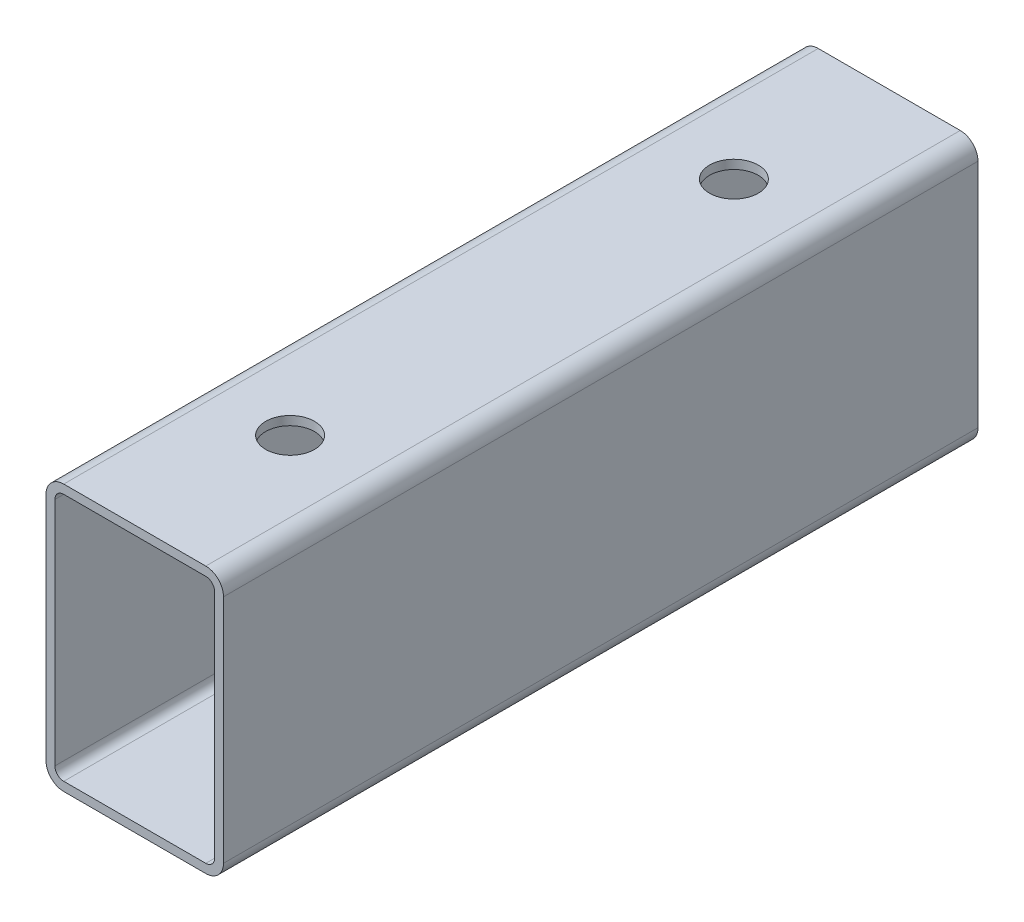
ISO-10303-21;
HEADER;
FILE_DESCRIPTION(('STEP AP214'),'2;1');
FILE_NAME('part.step','',(''),(''),'','','');
FILE_SCHEMA(('AUTOMOTIVE_DESIGN { 1 0 10303 214 1 1 1 1 }'));
ENDSEC;
DATA;
#1=APPLICATION_CONTEXT('core data for automotive mechanical design processes');
#2=APPLICATION_PROTOCOL_DEFINITION('international standard','automotive_design',2000,#1);
#3=PRODUCT_CONTEXT('',#1,'mechanical');
#4=PRODUCT('Part','Part','',(#3));
#5=PRODUCT_RELATED_PRODUCT_CATEGORY('part','',(#4));
#6=PRODUCT_DEFINITION_FORMATION('','',#4);
#7=PRODUCT_DEFINITION_CONTEXT('part definition',#1,'design');
#8=PRODUCT_DEFINITION('design','',#6,#7);
#9=PRODUCT_DEFINITION_SHAPE('','',#8);
#10=(LENGTH_UNIT() NAMED_UNIT(*) SI_UNIT(.MILLI.,.METRE.));
#11=(NAMED_UNIT(*) PLANE_ANGLE_UNIT() SI_UNIT($,.RADIAN.));
#12=(NAMED_UNIT(*) SI_UNIT($,.STERADIAN.) SOLID_ANGLE_UNIT());
#13=UNCERTAINTY_MEASURE_WITH_UNIT(LENGTH_MEASURE(1.E-05),#10,'distance_accuracy_value','');
#14=(GEOMETRIC_REPRESENTATION_CONTEXT(3) GLOBAL_UNCERTAINTY_ASSIGNED_CONTEXT((#13)) GLOBAL_UNIT_ASSIGNED_CONTEXT((#10,
#11,#12)) REPRESENTATION_CONTEXT('',''));
#15=CARTESIAN_POINT('',(0.,0.,0.));
#16=DIRECTION('',(0.,0.,1.));
#17=DIRECTION('',(1.,0.,0.));
#18=AXIS2_PLACEMENT_3D('',#15,#16,#17);
#19=CARTESIAN_POINT('',(16.,30.,85.));
#20=DIRECTION('',(0.,-1.,0.));
#21=DIRECTION('',(1.,0.,0.));
#22=AXIS2_PLACEMENT_3D('',#19,#20,#21);
#23=PLANE('',#22);
#24=CARTESIAN_POINT('',(0.,30.,-50.));
#25=DIRECTION('',(0.,1.,0.));
#26=DIRECTION('',(0.,0.,1.));
#27=AXIS2_PLACEMENT_3D('',#24,#25,#26);
#28=CIRCLE('',#27,5.5);
#29=CARTESIAN_POINT('',(0.,30.,-44.5));
#30=VERTEX_POINT('',#29);
#31=EDGE_CURVE('E269',#30,#30,#28,.T.);
#32=ORIENTED_EDGE('',*,*,#31,.F.);
#33=EDGE_LOOP('',(#32));
#34=FACE_BOUND('',#33,.T.);
#35=DIRECTION('',(-1.,0.,0.));
#36=VECTOR('',#35,1.);
#37=CARTESIAN_POINT('',(16.,30.,-85.));
#38=LINE('',#37,#36);
#39=CARTESIAN_POINT('',(16.,30.,-85.));
#40=VERTEX_POINT('',#39);
#41=CARTESIAN_POINT('',(-16.,30.,-85.));
#42=VERTEX_POINT('',#41);
#43=EDGE_CURVE('E218',#40,#42,#38,.T.);
#44=ORIENTED_EDGE('',*,*,#43,.T.);
#45=DIRECTION('',(0.,0.,-1.));
#46=VECTOR('',#45,1.);
#47=CARTESIAN_POINT('',(-16.,30.,85.));
#48=LINE('',#47,#46);
#49=CARTESIAN_POINT('',(-16.,30.,85.));
#50=VERTEX_POINT('',#49);
#51=EDGE_CURVE('E257',#50,#42,#48,.T.);
#52=ORIENTED_EDGE('',*,*,#51,.F.);
#53=DIRECTION('',(-1.,0.,0.));
#54=VECTOR('',#53,1.);
#55=CARTESIAN_POINT('',(16.,30.,85.));
#56=LINE('',#55,#54);
#57=CARTESIAN_POINT('',(16.,30.,85.));
#58=VERTEX_POINT('',#57);
#59=EDGE_CURVE('E235',#58,#50,#56,.T.);
#60=ORIENTED_EDGE('',*,*,#59,.F.);
#61=DIRECTION('',(0.,0.,-1.));
#62=VECTOR('',#61,1.);
#63=CARTESIAN_POINT('',(16.,30.,85.));
#64=LINE('',#63,#62);
#65=EDGE_CURVE('E260',#58,#40,#64,.T.);
#66=ORIENTED_EDGE('',*,*,#65,.T.);
#67=EDGE_LOOP('',(#44,#52,#60,#66));
#68=FACE_BOUND('',#67,.T.);
#69=CARTESIAN_POINT('',(0.,30.,50.));
#70=DIRECTION('',(0.,1.,0.));
#71=DIRECTION('',(0.,0.,1.));
#72=AXIS2_PLACEMENT_3D('',#69,#70,#71);
#73=CIRCLE('',#72,5.5);
#74=CARTESIAN_POINT('',(0.,30.,55.5));
#75=VERTEX_POINT('',#74);
#76=EDGE_CURVE('E281',#75,#75,#73,.T.);
#77=ORIENTED_EDGE('',*,*,#76,.F.);
#78=EDGE_LOOP('',(#77));
#79=FACE_BOUND('',#78,.T.);
#80=ADVANCED_FACE('F28',(#34,#68,#79),#23,.F.);
#81=CARTESIAN_POINT('',(16.,-30.,85.));
#82=DIRECTION('',(0.,1.,0.));
#83=DIRECTION('',(-1.,0.,0.));
#84=AXIS2_PLACEMENT_3D('',#81,#82,#83);
#85=PLANE('',#84);
#86=CARTESIAN_POINT('',(0.,-30.,-50.));
#87=DIRECTION('',(0.,1.,0.));
#88=DIRECTION('',(0.,0.,1.));
#89=AXIS2_PLACEMENT_3D('',#86,#87,#88);
#90=CIRCLE('',#89,5.5);
#91=CARTESIAN_POINT('',(0.,-30.,-44.5));
#92=VERTEX_POINT('',#91);
#93=EDGE_CURVE('E265',#92,#92,#90,.T.);
#94=ORIENTED_EDGE('',*,*,#93,.T.);
#95=EDGE_LOOP('',(#94));
#96=FACE_BOUND('',#95,.T.);
#97=DIRECTION('',(1.,0.,0.));
#98=VECTOR('',#97,1.);
#99=CARTESIAN_POINT('',(16.,-30.,-85.));
#100=LINE('',#99,#98);
#101=CARTESIAN_POINT('',(-16.,-30.,-85.));
#102=VERTEX_POINT('',#101);
#103=CARTESIAN_POINT('',(16.,-30.,-85.));
#104=VERTEX_POINT('',#103);
#105=EDGE_CURVE('E226',#102,#104,#100,.T.);
#106=ORIENTED_EDGE('',*,*,#105,.T.);
#107=DIRECTION('',(0.,0.,-1.));
#108=VECTOR('',#107,1.);
#109=CARTESIAN_POINT('',(16.,-30.,85.));
#110=LINE('',#109,#108);
#111=CARTESIAN_POINT('',(16.,-30.,85.));
#112=VERTEX_POINT('',#111);
#113=EDGE_CURVE('E245',#112,#104,#110,.T.);
#114=ORIENTED_EDGE('',*,*,#113,.F.);
#115=DIRECTION('',(1.,0.,0.));
#116=VECTOR('',#115,1.);
#117=CARTESIAN_POINT('',(16.,-30.,85.));
#118=LINE('',#117,#116);
#119=CARTESIAN_POINT('',(-16.,-30.,85.));
#120=VERTEX_POINT('',#119);
#121=EDGE_CURVE('E243',#120,#112,#118,.T.);
#122=ORIENTED_EDGE('',*,*,#121,.F.);
#123=DIRECTION('',(0.,0.,-1.));
#124=VECTOR('',#123,1.);
#125=CARTESIAN_POINT('',(-16.,-30.,85.));
#126=LINE('',#125,#124);
#127=EDGE_CURVE('E248',#120,#102,#126,.T.);
#128=ORIENTED_EDGE('',*,*,#127,.T.);
#129=EDGE_LOOP('',(#106,#114,#122,#128));
#130=FACE_BOUND('',#129,.T.);
#131=CARTESIAN_POINT('',(0.,-30.,50.));
#132=DIRECTION('',(0.,1.,0.));
#133=DIRECTION('',(0.,0.,1.));
#134=AXIS2_PLACEMENT_3D('',#131,#132,#133);
#135=CIRCLE('',#134,5.5);
#136=CARTESIAN_POINT('',(0.,-30.,55.5));
#137=VERTEX_POINT('',#136);
#138=EDGE_CURVE('E278',#137,#137,#135,.T.);
#139=ORIENTED_EDGE('',*,*,#138,.T.);
#140=EDGE_LOOP('',(#139));
#141=FACE_BOUND('',#140,.T.);
#142=ADVANCED_FACE('F288',(#96,#130,#141),#85,.F.);
#143=CARTESIAN_POINT('',(16.,28.,85.));
#144=DIRECTION('',(0.,-1.,0.));
#145=DIRECTION('',(1.,0.,0.));
#146=AXIS2_PLACEMENT_3D('',#143,#144,#145);
#147=PLANE('',#146);
#148=CARTESIAN_POINT('',(0.,28.,-50.));
#149=DIRECTION('',(0.,-1.,0.));
#150=DIRECTION('',(1.,0.,0.));
#151=AXIS2_PLACEMENT_3D('',#148,#149,#150);
#152=CIRCLE('',#151,5.5);
#153=CARTESIAN_POINT('',(5.5,28.,-50.));
#154=VERTEX_POINT('',#153);
#155=EDGE_CURVE('E165',#154,#154,#152,.F.);
#156=ORIENTED_EDGE('',*,*,#155,.T.);
#157=EDGE_LOOP('',(#156));
#158=FACE_BOUND('',#157,.T.);
#159=DIRECTION('',(-1.,0.,0.));
#160=VECTOR('',#159,1.);
#161=CARTESIAN_POINT('',(16.,28.,-85.));
#162=LINE('',#161,#160);
#163=CARTESIAN_POINT('',(16.,28.,-85.));
#164=VERTEX_POINT('',#163);
#165=CARTESIAN_POINT('',(-16.,28.,-85.));
#166=VERTEX_POINT('',#165);
#167=EDGE_CURVE('E173',#164,#166,#162,.T.);
#168=ORIENTED_EDGE('',*,*,#167,.F.);
#169=DIRECTION('',(0.,0.,-1.));
#170=VECTOR('',#169,1.);
#171=CARTESIAN_POINT('',(16.,28.,85.));
#172=LINE('',#171,#170);
#173=CARTESIAN_POINT('',(16.,28.,85.));
#174=VERTEX_POINT('',#173);
#175=EDGE_CURVE('E209',#174,#164,#172,.T.);
#176=ORIENTED_EDGE('',*,*,#175,.F.);
#177=DIRECTION('',(-1.,0.,0.));
#178=VECTOR('',#177,1.);
#179=CARTESIAN_POINT('',(16.,28.,85.));
#180=LINE('',#179,#178);
#181=CARTESIAN_POINT('',(-16.,28.,85.));
#182=VERTEX_POINT('',#181);
#183=EDGE_CURVE('E190',#174,#182,#180,.T.);
#184=ORIENTED_EDGE('',*,*,#183,.T.);
#185=DIRECTION('',(0.,0.,-1.));
#186=VECTOR('',#185,1.);
#187=CARTESIAN_POINT('',(-16.,28.,85.));
#188=LINE('',#187,#186);
#189=EDGE_CURVE('E207',#182,#166,#188,.T.);
#190=ORIENTED_EDGE('',*,*,#189,.T.);
#191=EDGE_LOOP('',(#168,#176,#184,#190));
#192=FACE_BOUND('',#191,.T.);
#193=CARTESIAN_POINT('',(0.,28.,50.));
#194=DIRECTION('',(0.,-1.,0.));
#195=DIRECTION('',(1.,0.,0.));
#196=AXIS2_PLACEMENT_3D('',#193,#194,#195);
#197=CIRCLE('',#196,5.5);
#198=CARTESIAN_POINT('',(5.5,28.,50.));
#199=VERTEX_POINT('',#198);
#200=EDGE_CURVE('E273',#199,#199,#197,.F.);
#201=ORIENTED_EDGE('',*,*,#200,.T.);
#202=EDGE_LOOP('',(#201));
#203=FACE_BOUND('',#202,.T.);
#204=ADVANCED_FACE('F294',(#158,#192,#203),#147,.T.);
#205=CARTESIAN_POINT('',(16.,-28.,85.));
#206=DIRECTION('',(0.,1.,0.));
#207=DIRECTION('',(-1.,0.,0.));
#208=AXIS2_PLACEMENT_3D('',#205,#206,#207);
#209=PLANE('',#208);
#210=CARTESIAN_POINT('',(0.,-28.,-50.));
#211=DIRECTION('',(0.,1.,0.));
#212=DIRECTION('',(-1.,0.,0.));
#213=AXIS2_PLACEMENT_3D('',#210,#211,#212);
#214=CIRCLE('',#213,5.5);
#215=CARTESIAN_POINT('',(-5.5,-28.,-50.));
#216=VERTEX_POINT('',#215);
#217=EDGE_CURVE('E168',#216,#216,#214,.F.);
#218=ORIENTED_EDGE('',*,*,#217,.T.);
#219=EDGE_LOOP('',(#218));
#220=FACE_BOUND('',#219,.T.);
#221=DIRECTION('',(1.,0.,0.));
#222=VECTOR('',#221,1.);
#223=CARTESIAN_POINT('',(16.,-28.,-85.));
#224=LINE('',#223,#222);
#225=CARTESIAN_POINT('',(-16.,-28.,-85.));
#226=VERTEX_POINT('',#225);
#227=CARTESIAN_POINT('',(16.,-28.,-85.));
#228=VERTEX_POINT('',#227);
#229=EDGE_CURVE('E164',#226,#228,#224,.T.);
#230=ORIENTED_EDGE('',*,*,#229,.F.);
#231=DIRECTION('',(0.,0.,-1.));
#232=VECTOR('',#231,1.);
#233=CARTESIAN_POINT('',(-16.,-28.,85.));
#234=LINE('',#233,#232);
#235=CARTESIAN_POINT('',(-16.,-28.,85.));
#236=VERTEX_POINT('',#235);
#237=EDGE_CURVE('E45',#236,#226,#234,.T.);
#238=ORIENTED_EDGE('',*,*,#237,.F.);
#239=DIRECTION('',(1.,0.,0.));
#240=VECTOR('',#239,1.);
#241=CARTESIAN_POINT('',(16.,-28.,85.));
#242=LINE('',#241,#240);
#243=CARTESIAN_POINT('',(16.,-28.,85.));
#244=VERTEX_POINT('',#243);
#245=EDGE_CURVE('E198',#236,#244,#242,.T.);
#246=ORIENTED_EDGE('',*,*,#245,.T.);
#247=DIRECTION('',(0.,0.,-1.));
#248=VECTOR('',#247,1.);
#249=CARTESIAN_POINT('',(16.,-28.,85.));
#250=LINE('',#249,#248);
#251=EDGE_CURVE('E200',#244,#228,#250,.T.);
#252=ORIENTED_EDGE('',*,*,#251,.T.);
#253=EDGE_LOOP('',(#230,#238,#246,#252));
#254=FACE_BOUND('',#253,.T.);
#255=CARTESIAN_POINT('',(0.,-28.,50.));
#256=DIRECTION('',(0.,1.,0.));
#257=DIRECTION('',(-1.,0.,0.));
#258=AXIS2_PLACEMENT_3D('',#255,#256,#257);
#259=CIRCLE('',#258,5.5);
#260=CARTESIAN_POINT('',(-5.5,-28.,50.));
#261=VERTEX_POINT('',#260);
#262=EDGE_CURVE('E32',#261,#261,#259,.F.);
#263=ORIENTED_EDGE('',*,*,#262,.T.);
#264=EDGE_LOOP('',(#263));
#265=FACE_BOUND('',#264,.T.);
#266=ADVANCED_FACE('F354',(#220,#254,#265),#209,.T.);
#267=CARTESIAN_POINT('',(16.,-26.,85.));
#268=DIRECTION('',(0.,0.,1.));
#269=DIRECTION('',(1.,0.,0.));
#270=AXIS2_PLACEMENT_3D('',#267,#268,#269);
#271=PLANE('',#270);
#272=CARTESIAN_POINT('',(16.,-26.,85.));
#273=DIRECTION('',(0.,0.,1.));
#274=DIRECTION('',(1.,0.,0.));
#275=AXIS2_PLACEMENT_3D('',#272,#273,#274);
#276=CIRCLE('',#275,4.);
#277=CARTESIAN_POINT('',(20.,-26.,85.));
#278=VERTEX_POINT('',#277);
#279=EDGE_CURVE('E228',#112,#278,#276,.T.);
#280=ORIENTED_EDGE('',*,*,#279,.T.);
#281=DIRECTION('',(0.,1.,0.));
#282=VECTOR('',#281,1.);
#283=CARTESIAN_POINT('',(20.,26.,85.));
#284=LINE('',#283,#282);
#285=CARTESIAN_POINT('',(20.,26.,85.));
#286=VERTEX_POINT('',#285);
#287=EDGE_CURVE('E231',#278,#286,#284,.T.);
#288=ORIENTED_EDGE('',*,*,#287,.T.);
#289=CARTESIAN_POINT('',(16.,26.,85.));
#290=DIRECTION('',(0.,0.,1.));
#291=DIRECTION('',(1.,0.,0.));
#292=AXIS2_PLACEMENT_3D('',#289,#290,#291);
#293=CIRCLE('',#292,4.);
#294=EDGE_CURVE('E233',#286,#58,#293,.T.);
#295=ORIENTED_EDGE('',*,*,#294,.T.);
#296=ORIENTED_EDGE('',*,*,#59,.T.);
#297=CARTESIAN_POINT('',(-16.,26.,85.));
#298=DIRECTION('',(0.,0.,1.));
#299=DIRECTION('',(-1.,0.,0.));
#300=AXIS2_PLACEMENT_3D('',#297,#298,#299);
#301=CIRCLE('',#300,4.);
#302=CARTESIAN_POINT('',(-20.,26.,85.));
#303=VERTEX_POINT('',#302);
#304=EDGE_CURVE('E237',#50,#303,#301,.T.);
#305=ORIENTED_EDGE('',*,*,#304,.T.);
#306=DIRECTION('',(0.,-1.,0.));
#307=VECTOR('',#306,1.);
#308=CARTESIAN_POINT('',(-20.,26.,85.));
#309=LINE('',#308,#307);
#310=CARTESIAN_POINT('',(-20.,-26.,85.));
#311=VERTEX_POINT('',#310);
#312=EDGE_CURVE('E239',#303,#311,#309,.T.);
#313=ORIENTED_EDGE('',*,*,#312,.T.);
#314=CARTESIAN_POINT('',(-16.,-26.,85.));
#315=DIRECTION('',(0.,0.,1.));
#316=DIRECTION('',(1.,0.,0.));
#317=AXIS2_PLACEMENT_3D('',#314,#315,#316);
#318=CIRCLE('',#317,4.);
#319=EDGE_CURVE('E241',#311,#120,#318,.T.);
#320=ORIENTED_EDGE('',*,*,#319,.T.);
#321=ORIENTED_EDGE('',*,*,#121,.T.);
#322=EDGE_LOOP('',(#280,#288,#295,#296,#305,#313,#320,#321));
#323=FACE_BOUND('',#322,.T.);
#324=DIRECTION('',(0.,1.,0.));
#325=VECTOR('',#324,1.);
#326=CARTESIAN_POINT('',(18.,26.,85.));
#327=LINE('',#326,#325);
#328=CARTESIAN_POINT('',(18.,-26.,85.));
#329=VERTEX_POINT('',#328);
#330=CARTESIAN_POINT('',(18.,26.,85.));
#331=VERTEX_POINT('',#330);
#332=EDGE_CURVE('E186',#329,#331,#327,.T.);
#333=ORIENTED_EDGE('',*,*,#332,.F.);
#334=CARTESIAN_POINT('',(16.,-26.,85.));
#335=DIRECTION('',(0.,0.,1.));
#336=DIRECTION('',(1.,0.,0.));
#337=AXIS2_PLACEMENT_3D('',#334,#335,#336);
#338=CIRCLE('',#337,2.);
#339=EDGE_CURVE('E158',#244,#329,#338,.T.);
#340=ORIENTED_EDGE('',*,*,#339,.F.);
#341=ORIENTED_EDGE('',*,*,#245,.F.);
#342=CARTESIAN_POINT('',(-16.,-26.,85.));
#343=DIRECTION('',(0.,0.,1.));
#344=DIRECTION('',(1.,0.,0.));
#345=AXIS2_PLACEMENT_3D('',#342,#343,#344);
#346=CIRCLE('',#345,2.);
#347=CARTESIAN_POINT('',(-18.,-26.,85.));
#348=VERTEX_POINT('',#347);
#349=EDGE_CURVE('E196',#348,#236,#346,.T.);
#350=ORIENTED_EDGE('',*,*,#349,.F.);
#351=DIRECTION('',(0.,-1.,0.));
#352=VECTOR('',#351,1.);
#353=CARTESIAN_POINT('',(-18.,26.,85.));
#354=LINE('',#353,#352);
#355=CARTESIAN_POINT('',(-18.,26.,85.));
#356=VERTEX_POINT('',#355);
#357=EDGE_CURVE('E194',#356,#348,#354,.T.);
#358=ORIENTED_EDGE('',*,*,#357,.F.);
#359=CARTESIAN_POINT('',(-16.,26.,85.));
#360=DIRECTION('',(0.,0.,1.));
#361=DIRECTION('',(1.,0.,0.));
#362=AXIS2_PLACEMENT_3D('',#359,#360,#361);
#363=CIRCLE('',#362,2.);
#364=EDGE_CURVE('E192',#182,#356,#363,.T.);
#365=ORIENTED_EDGE('',*,*,#364,.F.);
#366=ORIENTED_EDGE('',*,*,#183,.F.);
#367=CARTESIAN_POINT('',(16.,26.,85.));
#368=DIRECTION('',(0.,0.,1.));
#369=DIRECTION('',(1.,0.,0.));
#370=AXIS2_PLACEMENT_3D('',#367,#368,#369);
#371=CIRCLE('',#370,2.);
#372=EDGE_CURVE('E188',#331,#174,#371,.T.);
#373=ORIENTED_EDGE('',*,*,#372,.F.);
#374=EDGE_LOOP('',(#333,#340,#341,#350,#358,#365,#366,#373));
#375=FACE_BOUND('',#374,.T.);
#376=ADVANCED_FACE('F329',(#323,#375),#271,.T.);
#377=CARTESIAN_POINT('',(16.,-26.,-85.));
#378=DIRECTION('',(0.,0.,1.));
#379=DIRECTION('',(1.,0.,0.));
#380=AXIS2_PLACEMENT_3D('',#377,#378,#379);
#381=PLANE('',#380);
#382=CARTESIAN_POINT('',(16.,-26.,-85.));
#383=DIRECTION('',(0.,0.,1.));
#384=DIRECTION('',(1.,0.,0.));
#385=AXIS2_PLACEMENT_3D('',#382,#383,#384);
#386=CIRCLE('',#385,4.);
#387=CARTESIAN_POINT('',(20.,-26.,-85.));
#388=VERTEX_POINT('',#387);
#389=EDGE_CURVE('E159',#104,#388,#386,.T.);
#390=ORIENTED_EDGE('',*,*,#389,.F.);
#391=ORIENTED_EDGE('',*,*,#105,.F.);
#392=CARTESIAN_POINT('',(-16.,-26.,-85.));
#393=DIRECTION('',(0.,0.,1.));
#394=DIRECTION('',(1.,0.,0.));
#395=AXIS2_PLACEMENT_3D('',#392,#393,#394);
#396=CIRCLE('',#395,4.);
#397=CARTESIAN_POINT('',(-20.,-26.,-85.));
#398=VERTEX_POINT('',#397);
#399=EDGE_CURVE('E224',#398,#102,#396,.T.);
#400=ORIENTED_EDGE('',*,*,#399,.F.);
#401=DIRECTION('',(0.,-1.,0.));
#402=VECTOR('',#401,1.);
#403=CARTESIAN_POINT('',(-20.,26.,-85.));
#404=LINE('',#403,#402);
#405=CARTESIAN_POINT('',(-20.,26.,-85.));
#406=VERTEX_POINT('',#405);
#407=EDGE_CURVE('E222',#406,#398,#404,.T.);
#408=ORIENTED_EDGE('',*,*,#407,.F.);
#409=CARTESIAN_POINT('',(-16.,26.,-85.));
#410=DIRECTION('',(0.,0.,1.));
#411=DIRECTION('',(-1.,0.,0.));
#412=AXIS2_PLACEMENT_3D('',#409,#410,#411);
#413=CIRCLE('',#412,4.);
#414=EDGE_CURVE('E220',#42,#406,#413,.T.);
#415=ORIENTED_EDGE('',*,*,#414,.F.);
#416=ORIENTED_EDGE('',*,*,#43,.F.);
#417=CARTESIAN_POINT('',(16.,26.,-85.));
#418=DIRECTION('',(0.,0.,1.));
#419=DIRECTION('',(1.,0.,0.));
#420=AXIS2_PLACEMENT_3D('',#417,#418,#419);
#421=CIRCLE('',#420,4.);
#422=CARTESIAN_POINT('',(20.,26.,-85.));
#423=VERTEX_POINT('',#422);
#424=EDGE_CURVE('E216',#423,#40,#421,.T.);
#425=ORIENTED_EDGE('',*,*,#424,.F.);
#426=DIRECTION('',(0.,1.,0.));
#427=VECTOR('',#426,1.);
#428=CARTESIAN_POINT('',(20.,26.,-85.));
#429=LINE('',#428,#427);
#430=EDGE_CURVE('E214',#388,#423,#429,.T.);
#431=ORIENTED_EDGE('',*,*,#430,.F.);
#432=EDGE_LOOP('',(#390,#391,#400,#408,#415,#416,#425,#431));
#433=FACE_BOUND('',#432,.T.);
#434=CARTESIAN_POINT('',(16.,-26.,-85.));
#435=DIRECTION('',(0.,0.,1.));
#436=DIRECTION('',(1.,0.,0.));
#437=AXIS2_PLACEMENT_3D('',#434,#435,#436);
#438=CIRCLE('',#437,2.);
#439=CARTESIAN_POINT('',(18.,-26.,-85.));
#440=VERTEX_POINT('',#439);
#441=EDGE_CURVE('E53',#228,#440,#438,.T.);
#442=ORIENTED_EDGE('',*,*,#441,.T.);
#443=DIRECTION('',(0.,1.,0.));
#444=VECTOR('',#443,1.);
#445=CARTESIAN_POINT('',(18.,26.,-85.));
#446=LINE('',#445,#444);
#447=CARTESIAN_POINT('',(18.,26.,-85.));
#448=VERTEX_POINT('',#447);
#449=EDGE_CURVE('E145',#440,#448,#446,.T.);
#450=ORIENTED_EDGE('',*,*,#449,.T.);
#451=CARTESIAN_POINT('',(16.,26.,-85.));
#452=DIRECTION('',(0.,0.,1.));
#453=DIRECTION('',(1.,0.,0.));
#454=AXIS2_PLACEMENT_3D('',#451,#452,#453);
#455=CIRCLE('',#454,2.);
#456=EDGE_CURVE('E154',#448,#164,#455,.T.);
#457=ORIENTED_EDGE('',*,*,#456,.T.);
#458=ORIENTED_EDGE('',*,*,#167,.T.);
#459=CARTESIAN_POINT('',(-16.,26.,-85.));
#460=DIRECTION('',(0.,0.,1.));
#461=DIRECTION('',(1.,0.,0.));
#462=AXIS2_PLACEMENT_3D('',#459,#460,#461);
#463=CIRCLE('',#462,2.);
#464=CARTESIAN_POINT('',(-18.,26.,-85.));
#465=VERTEX_POINT('',#464);
#466=EDGE_CURVE('E176',#166,#465,#463,.T.);
#467=ORIENTED_EDGE('',*,*,#466,.T.);
#468=DIRECTION('',(0.,-1.,0.));
#469=VECTOR('',#468,1.);
#470=CARTESIAN_POINT('',(-18.,26.,-85.));
#471=LINE('',#470,#469);
#472=CARTESIAN_POINT('',(-18.,-26.,-85.));
#473=VERTEX_POINT('',#472);
#474=EDGE_CURVE('E179',#465,#473,#471,.T.);
#475=ORIENTED_EDGE('',*,*,#474,.T.);
#476=CARTESIAN_POINT('',(-16.,-26.,-85.));
#477=DIRECTION('',(0.,0.,1.));
#478=DIRECTION('',(1.,0.,0.));
#479=AXIS2_PLACEMENT_3D('',#476,#477,#478);
#480=CIRCLE('',#479,2.);
#481=EDGE_CURVE('E182',#473,#226,#480,.T.);
#482=ORIENTED_EDGE('',*,*,#481,.T.);
#483=ORIENTED_EDGE('',*,*,#229,.T.);
#484=EDGE_LOOP('',(#442,#450,#457,#458,#467,#475,#482,#483));
#485=FACE_BOUND('',#484,.T.);
#486=ADVANCED_FACE('F162',(#433,#485),#381,.F.);
#487=CARTESIAN_POINT('',(16.,-26.,85.));
#488=DIRECTION('',(0.,0.,-1.));
#489=DIRECTION('',(-1.,0.,0.));
#490=AXIS2_PLACEMENT_3D('',#487,#488,#489);
#491=CYLINDRICAL_SURFACE('',#490,4.);
#492=ORIENTED_EDGE('',*,*,#389,.T.);
#493=DIRECTION('',(0.,0.,-1.));
#494=VECTOR('',#493,1.);
#495=CARTESIAN_POINT('',(20.,-26.,85.));
#496=LINE('',#495,#494);
#497=EDGE_CURVE('E11',#278,#388,#496,.T.);
#498=ORIENTED_EDGE('',*,*,#497,.F.);
#499=ORIENTED_EDGE('',*,*,#279,.F.);
#500=ORIENTED_EDGE('',*,*,#113,.T.);
#501=EDGE_LOOP('',(#492,#498,#499,#500));
#502=FACE_BOUND('',#501,.T.);
#503=ADVANCED_FACE('F30',(#502),#491,.T.);
#504=CARTESIAN_POINT('',(20.,26.,85.));
#505=DIRECTION('',(-1.,0.,0.));
#506=DIRECTION('',(0.,0.,1.));
#507=AXIS2_PLACEMENT_3D('',#504,#505,#506);
#508=PLANE('',#507);
#509=ORIENTED_EDGE('',*,*,#430,.T.);
#510=DIRECTION('',(0.,0.,-1.));
#511=VECTOR('',#510,1.);
#512=CARTESIAN_POINT('',(20.,26.,85.));
#513=LINE('',#512,#511);
#514=EDGE_CURVE('E37',#286,#423,#513,.T.);
#515=ORIENTED_EDGE('',*,*,#514,.F.);
#516=ORIENTED_EDGE('',*,*,#287,.F.);
#517=ORIENTED_EDGE('',*,*,#497,.T.);
#518=EDGE_LOOP('',(#509,#515,#516,#517));
#519=FACE_BOUND('',#518,.T.);
#520=ADVANCED_FACE('F304',(#519),#508,.F.);
#521=CARTESIAN_POINT('',(16.,26.,85.));
#522=DIRECTION('',(0.,0.,-1.));
#523=DIRECTION('',(-1.,0.,0.));
#524=AXIS2_PLACEMENT_3D('',#521,#522,#523);
#525=CYLINDRICAL_SURFACE('',#524,4.);
#526=ORIENTED_EDGE('',*,*,#424,.T.);
#527=ORIENTED_EDGE('',*,*,#65,.F.);
#528=ORIENTED_EDGE('',*,*,#294,.F.);
#529=ORIENTED_EDGE('',*,*,#514,.T.);
#530=EDGE_LOOP('',(#526,#527,#528,#529));
#531=FACE_BOUND('',#530,.T.);
#532=ADVANCED_FACE('F302',(#531),#525,.T.);
#533=CARTESIAN_POINT('',(-16.,26.,85.));
#534=DIRECTION('',(0.,0.,-1.));
#535=DIRECTION('',(-1.,0.,0.));
#536=AXIS2_PLACEMENT_3D('',#533,#534,#535);
#537=CYLINDRICAL_SURFACE('',#536,4.);
#538=ORIENTED_EDGE('',*,*,#414,.T.);
#539=DIRECTION('',(0.,0.,-1.));
#540=VECTOR('',#539,1.);
#541=CARTESIAN_POINT('',(-20.,26.,85.));
#542=LINE('',#541,#540);
#543=EDGE_CURVE('E254',#303,#406,#542,.T.);
#544=ORIENTED_EDGE('',*,*,#543,.F.);
#545=ORIENTED_EDGE('',*,*,#304,.F.);
#546=ORIENTED_EDGE('',*,*,#51,.T.);
#547=EDGE_LOOP('',(#538,#544,#545,#546));
#548=FACE_BOUND('',#547,.T.);
#549=ADVANCED_FACE('F300',(#548),#537,.T.);
#550=CARTESIAN_POINT('',(-20.,26.,85.));
#551=DIRECTION('',(1.,0.,0.));
#552=DIRECTION('',(0.,0.,-1.));
#553=AXIS2_PLACEMENT_3D('',#550,#551,#552);
#554=PLANE('',#553);
#555=ORIENTED_EDGE('',*,*,#407,.T.);
#556=DIRECTION('',(0.,0.,-1.));
#557=VECTOR('',#556,1.);
#558=CARTESIAN_POINT('',(-20.,-26.,85.));
#559=LINE('',#558,#557);
#560=EDGE_CURVE('E251',#311,#398,#559,.T.);
#561=ORIENTED_EDGE('',*,*,#560,.F.);
#562=ORIENTED_EDGE('',*,*,#312,.F.);
#563=ORIENTED_EDGE('',*,*,#543,.T.);
#564=EDGE_LOOP('',(#555,#561,#562,#563));
#565=FACE_BOUND('',#564,.T.);
#566=ADVANCED_FACE('F344',(#565),#554,.F.);
#567=CARTESIAN_POINT('',(-16.,-26.,85.));
#568=DIRECTION('',(0.,0.,-1.));
#569=DIRECTION('',(-1.,0.,0.));
#570=AXIS2_PLACEMENT_3D('',#567,#568,#569);
#571=CYLINDRICAL_SURFACE('',#570,4.);
#572=ORIENTED_EDGE('',*,*,#399,.T.);
#573=ORIENTED_EDGE('',*,*,#127,.F.);
#574=ORIENTED_EDGE('',*,*,#319,.F.);
#575=ORIENTED_EDGE('',*,*,#560,.T.);
#576=EDGE_LOOP('',(#572,#573,#574,#575));
#577=FACE_BOUND('',#576,.T.);
#578=ADVANCED_FACE('F342',(#577),#571,.T.);
#579=CARTESIAN_POINT('',(16.,-26.,85.));
#580=DIRECTION('',(0.,0.,-1.));
#581=DIRECTION('',(-1.,0.,0.));
#582=AXIS2_PLACEMENT_3D('',#579,#580,#581);
#583=CYLINDRICAL_SURFACE('',#582,2.);
#584=ORIENTED_EDGE('',*,*,#441,.F.);
#585=ORIENTED_EDGE('',*,*,#251,.F.);
#586=ORIENTED_EDGE('',*,*,#339,.T.);
#587=DIRECTION('',(0.,0.,-1.));
#588=VECTOR('',#587,1.);
#589=CARTESIAN_POINT('',(18.,-26.,85.));
#590=LINE('',#589,#588);
#591=EDGE_CURVE('E147',#329,#440,#590,.T.);
#592=ORIENTED_EDGE('',*,*,#591,.T.);
#593=EDGE_LOOP('',(#584,#585,#586,#592));
#594=FACE_BOUND('',#593,.T.);
#595=ADVANCED_FACE('F156',(#594),#583,.F.);
#596=CARTESIAN_POINT('',(18.,26.,85.));
#597=DIRECTION('',(-1.,0.,0.));
#598=DIRECTION('',(0.,0.,1.));
#599=AXIS2_PLACEMENT_3D('',#596,#597,#598);
#600=PLANE('',#599);
#601=ORIENTED_EDGE('',*,*,#449,.F.);
#602=ORIENTED_EDGE('',*,*,#591,.F.);
#603=ORIENTED_EDGE('',*,*,#332,.T.);
#604=DIRECTION('',(0.,0.,-1.));
#605=VECTOR('',#604,1.);
#606=CARTESIAN_POINT('',(18.,26.,85.));
#607=LINE('',#606,#605);
#608=EDGE_CURVE('E150',#331,#448,#607,.T.);
#609=ORIENTED_EDGE('',*,*,#608,.T.);
#610=EDGE_LOOP('',(#601,#602,#603,#609));
#611=FACE_BOUND('',#610,.T.);
#612=ADVANCED_FACE('F146',(#611),#600,.T.);
#613=CARTESIAN_POINT('',(16.,26.,85.));
#614=DIRECTION('',(0.,0.,-1.));
#615=DIRECTION('',(-1.,0.,0.));
#616=AXIS2_PLACEMENT_3D('',#613,#614,#615);
#617=CYLINDRICAL_SURFACE('',#616,2.);
#618=ORIENTED_EDGE('',*,*,#456,.F.);
#619=ORIENTED_EDGE('',*,*,#608,.F.);
#620=ORIENTED_EDGE('',*,*,#372,.T.);
#621=ORIENTED_EDGE('',*,*,#175,.T.);
#622=EDGE_LOOP('',(#618,#619,#620,#621));
#623=FACE_BOUND('',#622,.T.);
#624=ADVANCED_FACE('F361',(#623),#617,.F.);
#625=CARTESIAN_POINT('',(-16.,26.,85.));
#626=DIRECTION('',(0.,0.,-1.));
#627=DIRECTION('',(-1.,0.,0.));
#628=AXIS2_PLACEMENT_3D('',#625,#626,#627);
#629=CYLINDRICAL_SURFACE('',#628,2.);
#630=ORIENTED_EDGE('',*,*,#466,.F.);
#631=ORIENTED_EDGE('',*,*,#189,.F.);
#632=ORIENTED_EDGE('',*,*,#364,.T.);
#633=DIRECTION('',(0.,0.,-1.));
#634=VECTOR('',#633,1.);
#635=CARTESIAN_POINT('',(-18.,26.,85.));
#636=LINE('',#635,#634);
#637=EDGE_CURVE('E205',#356,#465,#636,.T.);
#638=ORIENTED_EDGE('',*,*,#637,.T.);
#639=EDGE_LOOP('',(#630,#631,#632,#638));
#640=FACE_BOUND('',#639,.T.);
#641=ADVANCED_FACE('F364',(#640),#629,.F.);
#642=CARTESIAN_POINT('',(-18.,26.,85.));
#643=DIRECTION('',(1.,0.,0.));
#644=DIRECTION('',(0.,0.,-1.));
#645=AXIS2_PLACEMENT_3D('',#642,#643,#644);
#646=PLANE('',#645);
#647=ORIENTED_EDGE('',*,*,#474,.F.);
#648=ORIENTED_EDGE('',*,*,#637,.F.);
#649=ORIENTED_EDGE('',*,*,#357,.T.);
#650=DIRECTION('',(0.,0.,-1.));
#651=VECTOR('',#650,1.);
#652=CARTESIAN_POINT('',(-18.,-26.,85.));
#653=LINE('',#652,#651);
#654=EDGE_CURVE('E203',#348,#473,#653,.T.);
#655=ORIENTED_EDGE('',*,*,#654,.T.);
#656=EDGE_LOOP('',(#647,#648,#649,#655));
#657=FACE_BOUND('',#656,.T.);
#658=ADVANCED_FACE('F371',(#657),#646,.T.);
#659=CARTESIAN_POINT('',(-16.,-26.,85.));
#660=DIRECTION('',(0.,0.,-1.));
#661=DIRECTION('',(-1.,0.,0.));
#662=AXIS2_PLACEMENT_3D('',#659,#660,#661);
#663=CYLINDRICAL_SURFACE('',#662,2.);
#664=ORIENTED_EDGE('',*,*,#481,.F.);
#665=ORIENTED_EDGE('',*,*,#654,.F.);
#666=ORIENTED_EDGE('',*,*,#349,.T.);
#667=ORIENTED_EDGE('',*,*,#237,.T.);
#668=EDGE_LOOP('',(#664,#665,#666,#667));
#669=FACE_BOUND('',#668,.T.);
#670=ADVANCED_FACE('F375',(#669),#663,.F.);
#671=CARTESIAN_POINT('',(0.,37.6442873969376,-50.));
#672=DIRECTION('',(0.,1.,0.));
#673=DIRECTION('',(0.,0.,1.));
#674=AXIS2_PLACEMENT_3D('',#671,#672,#673);
#675=CYLINDRICAL_SURFACE('',#674,5.5);
#676=ORIENTED_EDGE('',*,*,#217,.F.);
#677=EDGE_LOOP('',(#676));
#678=FACE_BOUND('',#677,.T.);
#679=ORIENTED_EDGE('',*,*,#93,.F.);
#680=EDGE_LOOP('',(#679));
#681=FACE_BOUND('',#680,.T.);
#682=ADVANCED_FACE('F379',(#678,#681),#675,.F.);
#683=ORIENTED_EDGE('',*,*,#155,.F.);
#684=EDGE_LOOP('',(#683));
#685=FACE_BOUND('',#684,.T.);
#686=ORIENTED_EDGE('',*,*,#31,.T.);
#687=EDGE_LOOP('',(#686));
#688=FACE_BOUND('',#687,.T.);
#689=ADVANCED_FACE('F385',(#685,#688),#675,.F.);
#690=CARTESIAN_POINT('',(0.,37.6442873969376,50.));
#691=DIRECTION('',(0.,1.,0.));
#692=DIRECTION('',(0.,0.,1.));
#693=AXIS2_PLACEMENT_3D('',#690,#691,#692);
#694=CYLINDRICAL_SURFACE('',#693,5.5);
#695=ORIENTED_EDGE('',*,*,#262,.F.);
#696=EDGE_LOOP('',(#695));
#697=FACE_BOUND('',#696,.T.);
#698=ORIENTED_EDGE('',*,*,#138,.F.);
#699=EDGE_LOOP('',(#698));
#700=FACE_BOUND('',#699,.T.);
#701=ADVANCED_FACE('F387',(#697,#700),#694,.F.);
#702=ORIENTED_EDGE('',*,*,#200,.F.);
#703=EDGE_LOOP('',(#702));
#704=FACE_BOUND('',#703,.T.);
#705=ORIENTED_EDGE('',*,*,#76,.T.);
#706=EDGE_LOOP('',(#705));
#707=FACE_BOUND('',#706,.T.);
#708=ADVANCED_FACE('F285',(#704,#707),#694,.F.);
#709=CLOSED_SHELL('',(#80,#142,#204,#266,#376,#486,#503,#520,#532,#549,#566,#578,#595,#612,#624,
#641,#658,#670,#682,#689,#701,#708));
#710=MANIFOLD_SOLID_BREP('B2',#709);
#711=ADVANCED_BREP_SHAPE_REPRESENTATION('',(#18,#710),#14);
#712=SHAPE_DEFINITION_REPRESENTATION(#9,#711);
ENDSEC;
END-ISO-10303-21;
